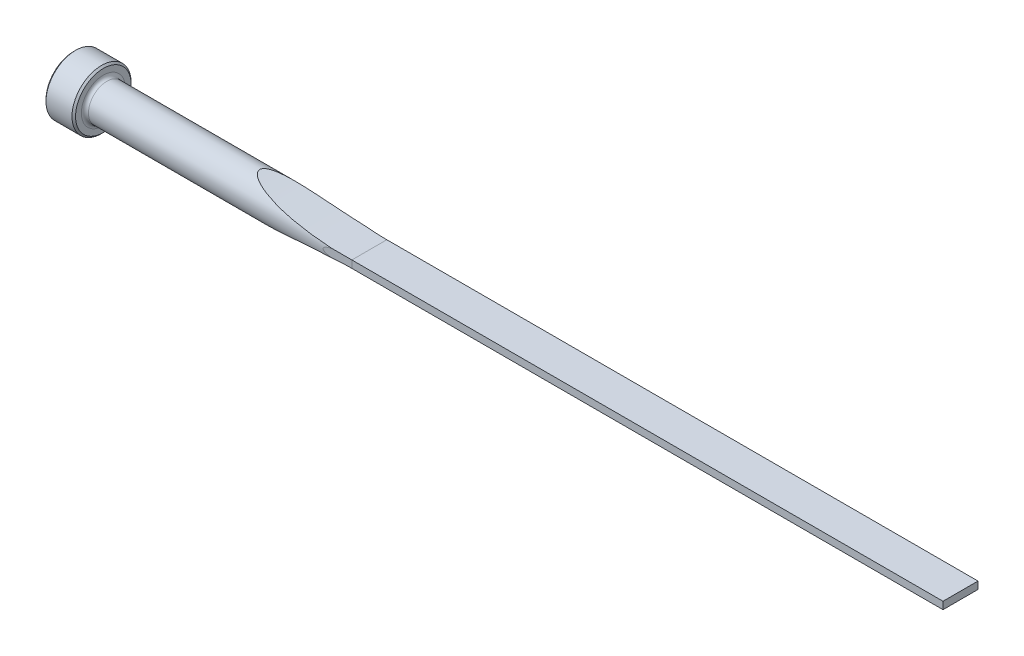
from build123d import *

# Parameters (mm, degrees)
CUT_EXTRUDE1_DEPTH = 191.711549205
CUT_EXTRUDE2_DEPTH = 191.711549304
FILLET1_R          = 0.762
CHAMFER1_SIZE      = 0.381


with BuildPart() as part:
    # Sketch1 → Revolve1 (revolve)
    with BuildSketch(Plane.XY, mode=Mode.PRIVATE) as revolve1_sk:
        Polygon((0, 0), (0, 6.35), (6.35, 6.35), (6.35, 3.9624), (190.5, 3.9624), (190.5, 0), align=None)
    revolve(revolve1_sk.sketch.rotate(Axis((0, 0, 0), (1, 0, 0)), 90), axis=Axis((0, 0, 0), (1, 0, 0)))

    # Sketch2 → Cut-Extrude1 (cut, symmetric)
    with BuildSketch(Plane.XY):
        with BuildLine():
            Line((190.5, 3.9624), (190.5, 0.7874))
            Line((190.5, 0.7874), (63.5, 0.7874))
            ThreePointArc((63.5, 0.7874), (51.620237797, 1.584725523), (39.953569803, 3.9624))
            Line((39.953569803, 3.9624), (190.5, 3.9624))
        make_face()
    cut_extrude1 = extrude(amount=CUT_EXTRUDE1_DEPTH, both=True, mode=Mode.SUBTRACT)

    # Mirror1: Cut-Extrude1 across plane
    add(cut_extrude1.mirror(Plane.ZX), mode=Mode.SUBTRACT)

    # Sketch3 → Cut-Extrude2 (cut, symmetric)
    with BuildSketch(Plane(origin=(0, 0, 0), x_dir=(1, 0, 0), z_dir=(0, 1, 0))):
        with BuildLine():
            Line((190.5, 3.9624), (190.5, 3.7592))
            Line((190.5, 3.7592), (63.5, 3.7592))
            ThreePointArc((63.5, 3.7592), (60.49463147, 3.810014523), (57.492698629, 3.9624))
            Line((57.492698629, 3.9624), (190.5, 3.9624))
        make_face()
    cut_extrude2 = extrude(amount=CUT_EXTRUDE2_DEPTH, both=True, mode=Mode.SUBTRACT)

    # Mirror2: Cut-Extrude2 across plane
    add(cut_extrude2.mirror(Plane.XY), mode=Mode.SUBTRACT)

    # Fillet1
    fillet1_edges = [part.edges().sort_by_distance(p)[0] for p in [
        (6.35, 0, -3.9624),
    ]]
    fillet(fillet1_edges, radius=FILLET1_R)

    # Chamfer1
    chamfer1_edges = [part.edges().sort_by_distance(p)[0] for p in [
        (6.35, 0, -6.35),
        (0, 0, -6.35),
    ]]
    chamfer(chamfer1_edges, length=CHAMFER1_SIZE)


solid = part.part
